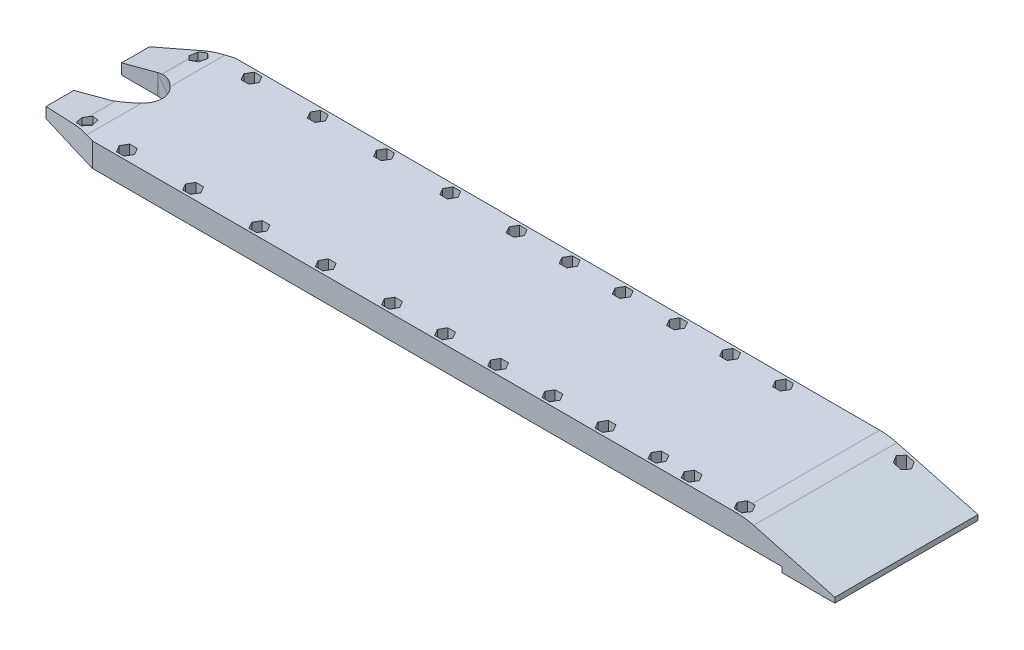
from build123d import *

# Parameters (mm, degrees)
SALIENTE_EXTRUIR1_DEPTH    = 18
CROQUIS2_W                 = 80
CROQUIS2_H                 = 108
CORTAR_EXTRUIR1_DEPTH      = 683.378194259
CROQUIS3_W                 = 40
CROQUIS3_H                 = 108
SALIENTE_EXTRUIR2_DEPTH    = 4
CHAFL_N1_SIZE              = 18.1
CHAFL_N1_SIZE2             = 67.550119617
CHAFL_N2_SIZE              = 10
CHAFL_N2_SIZE2             = 37.320508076
CORTAR_EXTRUIR2_DEPTH      = 613.780547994
CROQUIS6_R                 = 36
CORTAR_EXTRUIR3_DEPTH      = 65
CROQUIS7_W                 = 137
CROQUIS7_H                 = 76
CORTAR_EXTRUIR4_DEPTH      = 13
CORTAR_EXTRUIR5_DEPTH      = 57
CORTAR_EXTRUIR5_DEPTH_BACK = 57
CROQUIS8_R                 = 18
REDONDEO1_R                = 50
REDONDEO2_R                = 50
CORTAR_EXTRUIR6_DEPTH      = 10
CORTAR_EXTRUIR6_DEPTH_BACK = 613.649981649
CROQUIS9_R                 = 3.5
CORTAR_EXTRUIR7_DEPTH      = 7.25
CORTAR_EXTRUIR8_DEPTH      = 16.5


with BuildPart() as part:
    # Croquis1 → Saliente-Extruir1 (new body)
    with BuildSketch(Plane(origin=(0, 0, 0), x_dir=(1, 0, 0), z_dir=(0, 1, 0))):
        Polygon((0, 39), (50, 54), (610, 54), (680, 41), (680, 15), (670, 15), (670, -15), (680, -15), (680, -41), (610, -54), (50, -54), (0, -39), align=None)
    extrude(amount=SALIENTE_EXTRUIR1_DEPTH)

    # Croquis2 → Cortar-Extruir1 (cut, through all)
    with BuildSketch(Plane(origin=(0, 18, 0), x_dir=(1, 0, 0), z_dir=(0, 1, 0))):
        with Locations((650, 0)):
            Rectangle(CROQUIS2_W, CROQUIS2_H)
    extrude(amount=-CORTAR_EXTRUIR1_DEPTH, mode=Mode.SUBTRACT)

    # Croquis3 → Saliente-Extruir2 (add)
    with BuildSketch(Plane.XZ):
        with Locations((590, 0)):
            Rectangle(CROQUIS3_W, CROQUIS3_H)
    extrude(amount=SALIENTE_EXTRUIR2_DEPTH)

    # Chafl_n1
    chafl_n1_edges = [part.edges().sort_by_distance(p)[0] for p in [
        (610, 18, 0),
    ]]
    chafl_n1_side = [part.faces().sort_by_distance(p)[0] for p in [
        (610, 7, 0),
    ]]
    chamfer(chafl_n1_edges, length=CHAFL_N1_SIZE, length2=CHAFL_N1_SIZE2, reference=chafl_n1_side[0])

    # Chafl_n2
    chafl_n2_edges = [part.edges().sort_by_distance(p)[0] for p in [
        (0, 18, 0),
    ]]
    chafl_n2_side = [part.faces().sort_by_distance(p)[0] for p in [
        (0, 9, 0),
    ]]
    chamfer(chafl_n2_edges, length=CHAFL_N2_SIZE, length2=CHAFL_N2_SIZE2, reference=chafl_n2_side[0])

    # Croquis5 → Cortar-Extruir2 (cut, through all)
    with BuildSketch(Plane(origin=(0, 18, 0), x_dir=(1, 0, 0), z_dir=(0, 1, 0))):
        with BuildLine():
            Line((0, 18), (27, 18))
            ThreePointArc((27, 18), (45, 0), (27, -18))
            Line((27, -18), (0, -18))
            ThreePointArc((0, -18), (-18, 0), (0, 18))
        make_face()
    extrude(amount=-CORTAR_EXTRUIR2_DEPTH, mode=Mode.SUBTRACT)

    # Croquis6 → Cortar-Extruir3 (cut)
    with BuildSketch(Plane(origin=(0, 0, -54), x_dir=(-1, 0, 0), z_dir=(0, 0, -1))):
        with Locations((-515, -26)):
            Circle(CROQUIS6_R)
    extrude(amount=-CORTAR_EXTRUIR3_DEPTH, mode=Mode.SUBTRACT)

    # Croquis7 → Cortar-Extruir4 (cut)
    with BuildSketch(Plane.XZ):
        with Locations((222.5, 0)):
            Rectangle(CROQUIS7_W, CROQUIS7_H)
    extrude(amount=-CORTAR_EXTRUIR4_DEPTH, mode=Mode.SUBTRACT)

    # Croquis8 → Cortar-Extruir5 (cut, two sides: drawn at the far end of the back side and taken through both)
    with BuildSketch(Plane(origin=(7.759029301, -8.617275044, 0), x_dir=(0, 0, 1), z_dir=(-0.6691306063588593, 0.7431448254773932, 2.095659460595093e-15)).offset(-CORTAR_EXTRUIR5_DEPTH_BACK)):
        with Locations((0, 30.25886629)):
            Circle(CROQUIS8_R)
    extrude(amount=CORTAR_EXTRUIR5_DEPTH + CORTAR_EXTRUIR5_DEPTH_BACK, mode=Mode.SUBTRACT)

    # Redondeo1
    redondeo1_edges = [part.edges().sort_by_distance(p)[0] for p in [
        (30.858375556, 5.183216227, -17.581607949),
        (30.858375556, 5.183216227, 17.581607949),
    ]]
    fillet(redondeo1_edges, radius=REDONDEO1_R)

    # Redondeo2
    redondeo2_edges = [part.edges().sort_by_distance(p)[0] for p in [
        (542.449880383, 18, 0),
        (37.320508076, 18, -32.73628746),
        (37.320508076, 18, 32.73628746),
    ]]
    fillet(redondeo2_edges, radius=REDONDEO2_R)

    # Croquis9 → Cortar-Extruir6 (cut, two sides: drawn at the far end of the back side and taken through both)
    with BuildSketch(Plane.XZ.offset(-CORTAR_EXTRUIR6_DEPTH_BACK)):
        with Locations(Location((69, 47, 0), (0, 0, 90))):
            Circle(CROQUIS9_R)
        with Locations(Location((34, 42, 0), (0, 0, 90))):
            Circle(CROQUIS9_R)
        with Locations(Location((119, 47, 0), (0, 0, 90))):
            Circle(CROQUIS9_R)
        with Locations(Location((169, 47, 0), (0, 0, 90))):
            Circle(CROQUIS9_R)
        with Locations(Location((219, 47, 0), (0, 0, 90))):
            Circle(CROQUIS9_R)
        with Locations(Location((269, 47, 0), (0, 0, 90))):
            Circle(CROQUIS9_R)
        with Locations(Location((309, 47, 0), (0, 0, 90))):
            Circle(CROQUIS9_R)
        with Locations(Location((349, 47, 0), (0, 0, 90))):
            Circle(CROQUIS9_R)
        with Locations(Location((390, 47, 0), (0, 0, 90))):
            Circle(CROQUIS9_R)
        with Locations(Location((430, 47, 0), (0, 0, 90))):
            Circle(CROQUIS9_R)
        with Locations(Location((470, 47, 0), (0, 0, 90))):
            Circle(CROQUIS9_R)
        with Locations(Location((495, 47, 0), (0, 0, 90))):
            Circle(CROQUIS9_R)
        with Locations(Location((535, 47, 0), (0, 0, 90))):
            Circle(CROQUIS9_R)
        with Locations(Location((561, -47, 0), (0, 0, 90))):
            Circle(CROQUIS9_R)
        with Locations(Location((34, -42, 0), (0, 0, 90))):
            Circle(CROQUIS9_R)
        with Locations(Location((69, -47, 0), (0, 0, 90))):
            Circle(CROQUIS9_R)
        with Locations(Location((119, -47, 0), (0, 0, 90))):
            Circle(CROQUIS9_R)
        with Locations(Location((169, -47, 0), (0, 0, 90))):
            Circle(CROQUIS9_R)
        with Locations(Location((219, -47, 0), (0, 0, 90))):
            Circle(CROQUIS9_R)
        with Locations(Location((269, -47, 0), (0, 0, 90))):
            Circle(CROQUIS9_R)
        with Locations(Location((309, -47, 0), (0, 0, 90))):
            Circle(CROQUIS9_R)
        with Locations(Location((349, -47, 0), (0, 0, 90))):
            Circle(CROQUIS9_R)
        with Locations(Location((390, -47, 0), (0, 0, 90))):
            Circle(CROQUIS9_R)
        with Locations(Location((430, -47, 0), (0, 0, 90))):
            Circle(CROQUIS9_R)
        with Locations(Location((470, -47, 0), (0, 0, 90))):
            Circle(CROQUIS9_R)
    extrude(amount=CORTAR_EXTRUIR6_DEPTH + CORTAR_EXTRUIR6_DEPTH_BACK, mode=Mode.SUBTRACT)

    # Croquis10 → Cortar-Extruir7 (cut)
    with BuildSketch(Plane(origin=(0, 18, 0), x_dir=(1, 0, 0), z_dir=(0, 1, 0))):
        Polygon((71.886751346, 52), (66.113248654, 52), (63.226497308, 47), (66.113248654, 42), (71.886751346, 42), (74.773502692, 47), align=None)
        Polygon((121.886751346, 52), (116.113248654, 52), (113.226497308, 47), (116.113248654, 42), (121.886751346, 42), (124.773502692, 47), align=None)
        Polygon((171.886751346, 52), (166.113248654, 52), (163.226497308, 47), (166.113248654, 42), (171.886751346, 42), (174.773502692, 47), align=None)
        Polygon((224.773502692, 47), (221.886751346, 52), (216.113248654, 52), (213.226497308, 47), (216.113248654, 42), (221.886751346, 42), align=None)
        Polygon((274.773502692, 47), (271.886751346, 52), (266.113248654, 52), (263.226497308, 47), (266.113248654, 42), (271.886751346, 42), align=None)
        Polygon((314.773502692, 47), (311.886751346, 52), (306.113248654, 52), (303.226497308, 47), (306.113248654, 42), (311.886751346, 42), align=None)
        Polygon((354.773502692, 47), (351.886751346, 52), (346.113248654, 52), (343.226497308, 47), (346.113248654, 42), (351.886751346, 42), align=None)
        Polygon((395.773502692, 47), (392.886751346, 52), (387.113248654, 52), (384.226497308, 47), (387.113248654, 42), (392.886751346, 42), align=None)
        Polygon((435.773502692, 47), (432.886751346, 52), (427.113248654, 52), (424.226497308, 47), (427.113248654, 42), (432.886751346, 42), align=None)
        Polygon((475.773502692, 47), (472.886751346, 52), (467.113248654, 52), (464.226497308, 47), (467.113248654, 42), (472.886751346, 42), align=None)
        Polygon((39.530012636, 43.659003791), (35.32826689, 47.618633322), (29.798254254, 45.959629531), (28.469987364, 40.340996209), (32.67173311, 36.381366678), (38.201745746, 38.040370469), align=None)
        Polygon((38.201745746, -38.040370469), (39.530012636, -43.659003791), (35.32826689, -47.618633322), (29.798254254, -45.959629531), (28.469987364, -40.340996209), (32.67173311, -36.381366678), align=None)
        Polygon((472.886751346, -42), (475.773502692, -47), (472.886751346, -52), (467.113248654, -52), (464.226497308, -47), (467.113248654, -42), align=None)
        Polygon((432.886751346, -42), (435.773502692, -47), (432.886751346, -52), (427.113248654, -52), (424.226497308, -47), (427.113248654, -42), align=None)
        Polygon((392.886751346, -42), (395.773502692, -47), (392.886751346, -52), (387.113248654, -52), (384.226497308, -47), (387.113248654, -42), align=None)
        Polygon((351.886751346, -42), (354.773502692, -47), (351.886751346, -52), (346.113248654, -52), (343.226497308, -47), (346.113248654, -42), align=None)
        Polygon((311.886751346, -42), (314.773502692, -47), (311.886751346, -52), (306.113248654, -52), (303.226497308, -47), (306.113248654, -42), align=None)
        Polygon((271.886751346, -42), (274.773502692, -47), (271.886751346, -52), (266.113248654, -52), (263.226497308, -47), (266.113248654, -42), align=None)
        Polygon((221.886751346, -42), (224.773502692, -47), (221.886751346, -52), (216.113248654, -52), (213.226497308, -47), (216.113248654, -42), align=None)
        Polygon((174.773502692, -47), (171.886751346, -52), (166.113248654, -52), (163.226497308, -47), (166.113248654, -42), (171.886751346, -42), align=None)
        Polygon((124.773502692, -47), (121.886751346, -52), (116.113248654, -52), (113.226497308, -47), (116.113248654, -42), (121.886751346, -42), align=None)
        Polygon((74.773502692, -47), (71.886751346, -52), (66.113248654, -52), (63.226497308, -47), (66.113248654, -42), (71.886751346, -42), align=None)
        Polygon((497.886751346, -42), (492.113248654, -42), (489.226497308, -47), (492.113248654, -52), (497.886751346, -52), (500.773502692, -47), align=None)
        Polygon((537.886751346, -42), (532.113248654, -42), (529.226497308, -47), (532.113248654, -52), (537.886751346, -52), (540.773502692, -47), align=None)
    extrude(amount=-CORTAR_EXTRUIR7_DEPTH, mode=Mode.SUBTRACT)

    # Croquis11 → Cortar-Extruir8 (cut)
    with BuildSketch(Plane(origin=(0, 18, 0), x_dir=(1, 0, 0), z_dir=(0, 1, 0))):
        Polygon((566.773502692, 47), (563.886751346, 52), (558.113248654, 52), (555.226497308, 47), (558.113248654, 42), (563.886751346, 42), align=None)
    extrude(amount=-CORTAR_EXTRUIR8_DEPTH, mode=Mode.SUBTRACT)


solid = part.part
